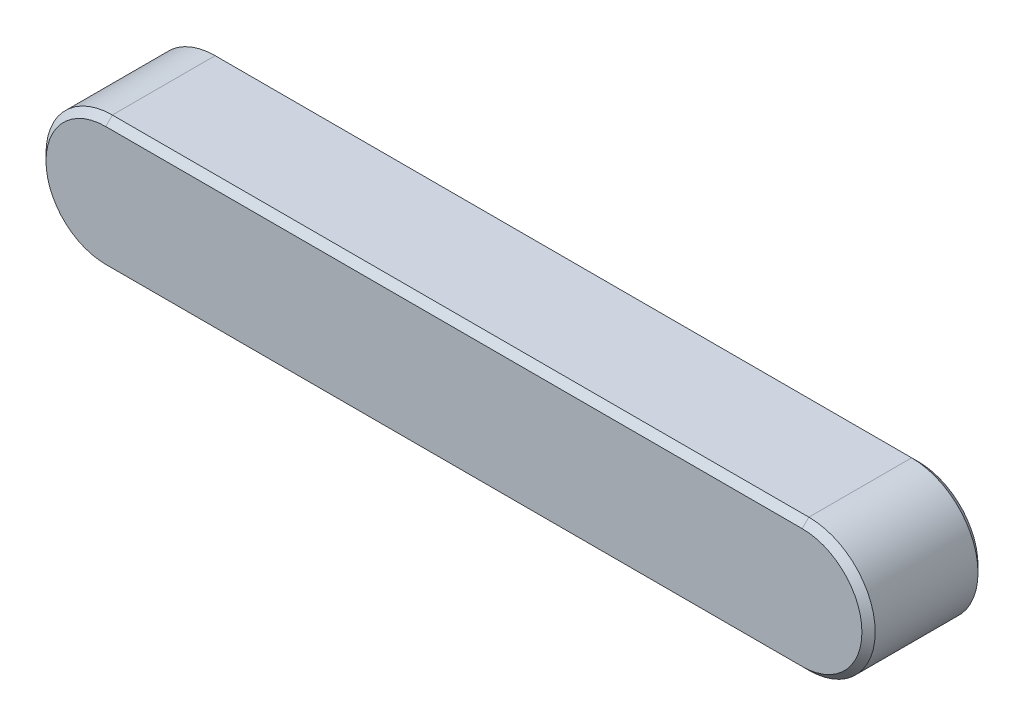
ISO-10303-21;
HEADER;
FILE_DESCRIPTION(('STEP AP214'),'2;1');
FILE_NAME('part.step','',(''),(''),'','','');
FILE_SCHEMA(('AUTOMOTIVE_DESIGN { 1 0 10303 214 1 1 1 1 }'));
ENDSEC;
DATA;
#1=APPLICATION_CONTEXT('core data for automotive mechanical design processes');
#2=APPLICATION_PROTOCOL_DEFINITION('international standard','automotive_design',2000,#1);
#3=PRODUCT_CONTEXT('',#1,'mechanical');
#4=PRODUCT('Part','Part','',(#3));
#5=PRODUCT_RELATED_PRODUCT_CATEGORY('part','',(#4));
#6=PRODUCT_DEFINITION_FORMATION('','',#4);
#7=PRODUCT_DEFINITION_CONTEXT('part definition',#1,'design');
#8=PRODUCT_DEFINITION('design','',#6,#7);
#9=PRODUCT_DEFINITION_SHAPE('','',#8);
#10=(LENGTH_UNIT() NAMED_UNIT(*) SI_UNIT(.MILLI.,.METRE.));
#11=(NAMED_UNIT(*) PLANE_ANGLE_UNIT() SI_UNIT($,.RADIAN.));
#12=(NAMED_UNIT(*) SI_UNIT($,.STERADIAN.) SOLID_ANGLE_UNIT());
#13=UNCERTAINTY_MEASURE_WITH_UNIT(LENGTH_MEASURE(1.E-05),#10,'distance_accuracy_value','');
#14=(GEOMETRIC_REPRESENTATION_CONTEXT(3) GLOBAL_UNCERTAINTY_ASSIGNED_CONTEXT((#13)) GLOBAL_UNIT_ASSIGNED_CONTEXT((#10,
#11,#12)) REPRESENTATION_CONTEXT('',''));
#15=CARTESIAN_POINT('',(0.,0.,0.));
#16=DIRECTION('',(0.,0.,1.));
#17=DIRECTION('',(1.,0.,0.));
#18=AXIS2_PLACEMENT_3D('',#15,#16,#17);
#19=CARTESIAN_POINT('',(0.,8.,7.));
#20=DIRECTION('',(0.,-1.,0.));
#21=DIRECTION('',(0.,0.,-1.));
#22=AXIS2_PLACEMENT_3D('',#19,#20,#21);
#23=PLANE('',#22);
#24=DIRECTION('',(0.,0.,-1.));
#25=VECTOR('',#24,1.);
#26=CARTESIAN_POINT('',(42.,8.,7.));
#27=LINE('',#26,#25);
#28=CARTESIAN_POINT('',(42.,8.,6.6));
#29=VERTEX_POINT('',#28);
#30=CARTESIAN_POINT('',(42.,8.,0.400000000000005));
#31=VERTEX_POINT('',#30);
#32=EDGE_CURVE('E146',#29,#31,#27,.T.);
#33=ORIENTED_EDGE('',*,*,#32,.T.);
#34=DIRECTION('',(-1.,0.,0.));
#35=VECTOR('',#34,1.);
#36=CARTESIAN_POINT('',(0.,8.,0.400000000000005));
#37=LINE('',#36,#35);
#38=CARTESIAN_POINT('',(0.,8.,0.400000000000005));
#39=VERTEX_POINT('',#38);
#40=EDGE_CURVE('E157',#31,#39,#37,.T.);
#41=ORIENTED_EDGE('',*,*,#40,.T.);
#42=DIRECTION('',(0.,0.,-1.));
#43=VECTOR('',#42,1.);
#44=CARTESIAN_POINT('',(0.,8.,7.));
#45=LINE('',#44,#43);
#46=CARTESIAN_POINT('',(0.,8.,6.6));
#47=VERTEX_POINT('',#46);
#48=EDGE_CURVE('E128',#47,#39,#45,.T.);
#49=ORIENTED_EDGE('',*,*,#48,.F.);
#50=DIRECTION('',(1.,0.,0.));
#51=VECTOR('',#50,1.);
#52=CARTESIAN_POINT('',(42.,8.,6.6));
#53=LINE('',#52,#51);
#54=EDGE_CURVE('E159',#47,#29,#53,.T.);
#55=ORIENTED_EDGE('',*,*,#54,.T.);
#56=EDGE_LOOP('',(#33,#41,#49,#55));
#57=FACE_BOUND('',#56,.T.);
#58=ADVANCED_FACE('F41',(#57),#23,.F.);
#59=CARTESIAN_POINT('',(0.,4.,7.));
#60=DIRECTION('',(0.,0.,-1.));
#61=DIRECTION('',(-1.,0.,0.));
#62=AXIS2_PLACEMENT_3D('',#59,#60,#61);
#63=CYLINDRICAL_SURFACE('',#62,4.);
#64=ORIENTED_EDGE('',*,*,#48,.T.);
#65=CARTESIAN_POINT('',(0.,4.,0.400000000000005));
#66=DIRECTION('',(0.,0.,1.));
#67=DIRECTION('',(1.,0.,0.));
#68=AXIS2_PLACEMENT_3D('',#65,#66,#67);
#69=CIRCLE('',#68,4.);
#70=CARTESIAN_POINT('',(0.,0.,0.400000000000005));
#71=VERTEX_POINT('',#70);
#72=EDGE_CURVE('E130',#39,#71,#69,.T.);
#73=ORIENTED_EDGE('',*,*,#72,.T.);
#74=DIRECTION('',(0.,0.,-1.));
#75=VECTOR('',#74,1.);
#76=CARTESIAN_POINT('',(0.,0.,7.));
#77=LINE('',#76,#75);
#78=CARTESIAN_POINT('',(0.,0.,6.6));
#79=VERTEX_POINT('',#78);
#80=EDGE_CURVE('E109',#79,#71,#77,.T.);
#81=ORIENTED_EDGE('',*,*,#80,.F.);
#82=CARTESIAN_POINT('',(0.,4.,6.6));
#83=DIRECTION('',(0.,0.,1.));
#84=DIRECTION('',(1.,0.,0.));
#85=AXIS2_PLACEMENT_3D('',#82,#83,#84);
#86=CIRCLE('',#85,4.);
#87=EDGE_CURVE('E123',#79,#47,#86,.F.);
#88=ORIENTED_EDGE('',*,*,#87,.T.);
#89=EDGE_LOOP('',(#64,#73,#81,#88));
#90=FACE_BOUND('',#89,.T.);
#91=ADVANCED_FACE('F121',(#90),#63,.T.);
#92=CARTESIAN_POINT('',(0.,0.,7.));
#93=DIRECTION('',(0.,-1.,0.));
#94=DIRECTION('',(0.,0.,-1.));
#95=AXIS2_PLACEMENT_3D('',#92,#93,#94);
#96=PLANE('',#95);
#97=ORIENTED_EDGE('',*,*,#80,.T.);
#98=DIRECTION('',(1.,0.,0.));
#99=VECTOR('',#98,1.);
#100=CARTESIAN_POINT('',(42.,0.,0.400000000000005));
#101=LINE('',#100,#99);
#102=CARTESIAN_POINT('',(42.,0.,0.400000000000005));
#103=VERTEX_POINT('',#102);
#104=EDGE_CURVE('E120',#71,#103,#101,.T.);
#105=ORIENTED_EDGE('',*,*,#104,.T.);
#106=DIRECTION('',(0.,0.,-1.));
#107=VECTOR('',#106,1.);
#108=CARTESIAN_POINT('',(42.,0.,7.));
#109=LINE('',#108,#107);
#110=CARTESIAN_POINT('',(42.,0.,6.6));
#111=VERTEX_POINT('',#110);
#112=EDGE_CURVE('E115',#111,#103,#109,.T.);
#113=ORIENTED_EDGE('',*,*,#112,.F.);
#114=DIRECTION('',(-1.,0.,0.));
#115=VECTOR('',#114,1.);
#116=CARTESIAN_POINT('',(0.,0.,6.6));
#117=LINE('',#116,#115);
#118=EDGE_CURVE('E110',#111,#79,#117,.T.);
#119=ORIENTED_EDGE('',*,*,#118,.T.);
#120=EDGE_LOOP('',(#97,#105,#113,#119));
#121=FACE_BOUND('',#120,.T.);
#122=ADVANCED_FACE('F107',(#121),#96,.T.);
#123=CARTESIAN_POINT('',(42.,4.,7.));
#124=DIRECTION('',(0.,0.,-1.));
#125=DIRECTION('',(-1.,0.,0.));
#126=AXIS2_PLACEMENT_3D('',#123,#124,#125);
#127=CYLINDRICAL_SURFACE('',#126,4.);
#128=ORIENTED_EDGE('',*,*,#112,.T.);
#129=CARTESIAN_POINT('',(42.,4.,0.400000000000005));
#130=DIRECTION('',(0.,0.,1.));
#131=DIRECTION('',(1.,0.,0.));
#132=AXIS2_PLACEMENT_3D('',#129,#130,#131);
#133=CIRCLE('',#132,4.);
#134=EDGE_CURVE('E162',#103,#31,#133,.T.);
#135=ORIENTED_EDGE('',*,*,#134,.T.);
#136=ORIENTED_EDGE('',*,*,#32,.F.);
#137=CARTESIAN_POINT('',(42.,4.,6.6));
#138=DIRECTION('',(0.,0.,1.));
#139=DIRECTION('',(1.,0.,0.));
#140=AXIS2_PLACEMENT_3D('',#137,#138,#139);
#141=CIRCLE('',#140,4.);
#142=EDGE_CURVE('E165',#29,#111,#141,.F.);
#143=ORIENTED_EDGE('',*,*,#142,.T.);
#144=EDGE_LOOP('',(#128,#135,#136,#143));
#145=FACE_BOUND('',#144,.T.);
#146=ADVANCED_FACE('F205',(#145),#127,.T.);
#147=CARTESIAN_POINT('',(0.,0.,7.));
#148=DIRECTION('',(0.,0.,1.));
#149=DIRECTION('',(1.,0.,0.));
#150=AXIS2_PLACEMENT_3D('',#147,#148,#149);
#151=PLANE('',#150);
#152=DIRECTION('',(1.,0.,0.));
#153=VECTOR('',#152,1.);
#154=CARTESIAN_POINT('',(0.,0.399999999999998,7.));
#155=LINE('',#154,#153);
#156=CARTESIAN_POINT('',(0.,0.399999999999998,7.));
#157=VERTEX_POINT('',#156);
#158=CARTESIAN_POINT('',(42.,0.399999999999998,7.));
#159=VERTEX_POINT('',#158);
#160=EDGE_CURVE('E49',#157,#159,#155,.T.);
#161=ORIENTED_EDGE('',*,*,#160,.T.);
#162=CARTESIAN_POINT('',(42.,4.,7.));
#163=DIRECTION('',(0.,0.,1.));
#164=DIRECTION('',(1.,0.,0.));
#165=AXIS2_PLACEMENT_3D('',#162,#163,#164);
#166=CIRCLE('',#165,3.6);
#167=CARTESIAN_POINT('',(42.,7.6,7.));
#168=VERTEX_POINT('',#167);
#169=EDGE_CURVE('E11',#159,#168,#166,.T.);
#170=ORIENTED_EDGE('',*,*,#169,.T.);
#171=DIRECTION('',(-1.,0.,0.));
#172=VECTOR('',#171,1.);
#173=CARTESIAN_POINT('',(0.,7.6,7.));
#174=LINE('',#173,#172);
#175=CARTESIAN_POINT('',(0.,7.6,7.));
#176=VERTEX_POINT('',#175);
#177=EDGE_CURVE('E156',#168,#176,#174,.T.);
#178=ORIENTED_EDGE('',*,*,#177,.T.);
#179=CARTESIAN_POINT('',(0.,4.,7.));
#180=DIRECTION('',(0.,0.,1.));
#181=DIRECTION('',(1.,0.,0.));
#182=AXIS2_PLACEMENT_3D('',#179,#180,#181);
#183=CIRCLE('',#182,3.6);
#184=EDGE_CURVE('E64',#176,#157,#183,.T.);
#185=ORIENTED_EDGE('',*,*,#184,.T.);
#186=EDGE_LOOP('',(#161,#170,#178,#185));
#187=FACE_BOUND('',#186,.T.);
#188=ADVANCED_FACE('F210',(#187),#151,.T.);
#189=CARTESIAN_POINT('',(0.,0.,0.));
#190=DIRECTION('',(0.,0.,1.));
#191=DIRECTION('',(1.,0.,0.));
#192=AXIS2_PLACEMENT_3D('',#189,#190,#191);
#193=PLANE('',#192);
#194=DIRECTION('',(-1.,0.,0.));
#195=VECTOR('',#194,1.);
#196=CARTESIAN_POINT('',(0.,0.400000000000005,0.));
#197=LINE('',#196,#195);
#198=CARTESIAN_POINT('',(42.,0.400000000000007,0.));
#199=VERTEX_POINT('',#198);
#200=CARTESIAN_POINT('',(0.,0.400000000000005,0.));
#201=VERTEX_POINT('',#200);
#202=EDGE_CURVE('E169',#199,#201,#197,.T.);
#203=ORIENTED_EDGE('',*,*,#202,.T.);
#204=CARTESIAN_POINT('',(0.,4.,0.));
#205=DIRECTION('',(0.,0.,1.));
#206=DIRECTION('',(1.,0.,0.));
#207=AXIS2_PLACEMENT_3D('',#204,#205,#206);
#208=CIRCLE('',#207,3.6);
#209=CARTESIAN_POINT('',(0.,7.6,0.));
#210=VERTEX_POINT('',#209);
#211=EDGE_CURVE('E117',#201,#210,#208,.F.);
#212=ORIENTED_EDGE('',*,*,#211,.T.);
#213=DIRECTION('',(1.,0.,0.));
#214=VECTOR('',#213,1.);
#215=CARTESIAN_POINT('',(0.,7.6,0.));
#216=LINE('',#215,#214);
#217=CARTESIAN_POINT('',(42.,7.6,0.));
#218=VERTEX_POINT('',#217);
#219=EDGE_CURVE('E173',#210,#218,#216,.T.);
#220=ORIENTED_EDGE('',*,*,#219,.T.);
#221=CARTESIAN_POINT('',(42.,4.,0.));
#222=DIRECTION('',(0.,0.,1.));
#223=DIRECTION('',(1.,0.,0.));
#224=AXIS2_PLACEMENT_3D('',#221,#222,#223);
#225=CIRCLE('',#224,3.6);
#226=EDGE_CURVE('E171',#218,#199,#225,.F.);
#227=ORIENTED_EDGE('',*,*,#226,.T.);
#228=EDGE_LOOP('',(#203,#212,#220,#227));
#229=FACE_BOUND('',#228,.T.);
#230=ADVANCED_FACE('F235',(#229),#193,.F.);
#231=CARTESIAN_POINT('',(42.,4.,0.));
#232=DIRECTION('',(0.,0.,1.));
#233=DIRECTION('',(1.,0.,0.));
#234=AXIS2_PLACEMENT_3D('',#231,#232,#233);
#235=CONICAL_SURFACE('',#234,3.6,0.785398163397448);
#236=DIRECTION('',(0.,-0.707106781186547,0.707106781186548));
#237=VECTOR('',#236,1.);
#238=CARTESIAN_POINT('',(42.,0.400000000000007,0.));
#239=LINE('',#238,#237);
#240=EDGE_CURVE('E150',#199,#103,#239,.T.);
#241=ORIENTED_EDGE('',*,*,#240,.F.);
#242=ORIENTED_EDGE('',*,*,#226,.F.);
#243=DIRECTION('',(0.,-0.707106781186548,-0.707106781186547));
#244=VECTOR('',#243,1.);
#245=CARTESIAN_POINT('',(42.,8.,0.400000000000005));
#246=LINE('',#245,#244);
#247=EDGE_CURVE('E144',#31,#218,#246,.T.);
#248=ORIENTED_EDGE('',*,*,#247,.F.);
#249=ORIENTED_EDGE('',*,*,#134,.F.);
#250=EDGE_LOOP('',(#241,#242,#248,#249));
#251=FACE_BOUND('',#250,.T.);
#252=ADVANCED_FACE('F186',(#251),#235,.T.);
#253=CARTESIAN_POINT('',(0.,8.,0.400000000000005));
#254=DIRECTION('',(0.,-0.707106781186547,0.707106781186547));
#255=DIRECTION('',(0.,-0.707106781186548,-0.707106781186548));
#256=AXIS2_PLACEMENT_3D('',#253,#254,#255);
#257=PLANE('',#256);
#258=ORIENTED_EDGE('',*,*,#247,.T.);
#259=ORIENTED_EDGE('',*,*,#219,.F.);
#260=DIRECTION('',(0.,-0.707106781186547,-0.707106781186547));
#261=VECTOR('',#260,1.);
#262=CARTESIAN_POINT('',(0.,8.,0.400000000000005));
#263=LINE('',#262,#261);
#264=EDGE_CURVE('E153',#39,#210,#263,.T.);
#265=ORIENTED_EDGE('',*,*,#264,.F.);
#266=ORIENTED_EDGE('',*,*,#40,.F.);
#267=EDGE_LOOP('',(#258,#259,#265,#266));
#268=FACE_BOUND('',#267,.T.);
#269=ADVANCED_FACE('F195',(#268),#257,.F.);
#270=CARTESIAN_POINT('',(0.,0.400000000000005,0.));
#271=DIRECTION('',(0.,-0.707106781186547,-0.707106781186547));
#272=DIRECTION('',(0.,0.707106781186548,-0.707106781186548));
#273=AXIS2_PLACEMENT_3D('',#270,#271,#272);
#274=PLANE('',#273);
#275=ORIENTED_EDGE('',*,*,#240,.T.);
#276=ORIENTED_EDGE('',*,*,#104,.F.);
#277=DIRECTION('',(0.,-0.707106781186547,0.707106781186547));
#278=VECTOR('',#277,1.);
#279=CARTESIAN_POINT('',(0.,0.400000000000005,0.));
#280=LINE('',#279,#278);
#281=EDGE_CURVE('E138',#201,#71,#280,.T.);
#282=ORIENTED_EDGE('',*,*,#281,.F.);
#283=ORIENTED_EDGE('',*,*,#202,.F.);
#284=EDGE_LOOP('',(#275,#276,#282,#283));
#285=FACE_BOUND('',#284,.T.);
#286=ADVANCED_FACE('F201',(#285),#274,.T.);
#287=CARTESIAN_POINT('',(0.,4.,0.400000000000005));
#288=DIRECTION('',(0.,0.,1.));
#289=DIRECTION('',(1.,0.,0.));
#290=AXIS2_PLACEMENT_3D('',#287,#288,#289);
#291=CONICAL_SURFACE('',#290,4.,0.785398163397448);
#292=ORIENTED_EDGE('',*,*,#264,.T.);
#293=ORIENTED_EDGE('',*,*,#211,.F.);
#294=ORIENTED_EDGE('',*,*,#281,.T.);
#295=ORIENTED_EDGE('',*,*,#72,.F.);
#296=EDGE_LOOP('',(#292,#293,#294,#295));
#297=FACE_BOUND('',#296,.T.);
#298=ADVANCED_FACE('F198',(#297),#291,.T.);
#299=CARTESIAN_POINT('',(0.,4.,7.));
#300=DIRECTION('',(0.,0.,-1.));
#301=DIRECTION('',(-1.,0.,0.));
#302=AXIS2_PLACEMENT_3D('',#299,#300,#301);
#303=CONICAL_SURFACE('',#302,3.6,0.785398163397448);
#304=DIRECTION('',(0.,-0.707106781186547,-0.707106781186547));
#305=VECTOR('',#304,1.);
#306=CARTESIAN_POINT('',(0.,0.399999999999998,7.));
#307=LINE('',#306,#305);
#308=EDGE_CURVE('E132',#157,#79,#307,.T.);
#309=ORIENTED_EDGE('',*,*,#308,.F.);
#310=ORIENTED_EDGE('',*,*,#184,.F.);
#311=DIRECTION('',(0.,-0.707106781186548,0.707106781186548));
#312=VECTOR('',#311,1.);
#313=CARTESIAN_POINT('',(0.,8.,6.6));
#314=LINE('',#313,#312);
#315=EDGE_CURVE('E44',#47,#176,#314,.T.);
#316=ORIENTED_EDGE('',*,*,#315,.F.);
#317=ORIENTED_EDGE('',*,*,#87,.F.);
#318=EDGE_LOOP('',(#309,#310,#316,#317));
#319=FACE_BOUND('',#318,.T.);
#320=ADVANCED_FACE('F43',(#319),#303,.T.);
#321=CARTESIAN_POINT('',(0.,7.6,7.));
#322=DIRECTION('',(0.,0.707106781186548,0.707106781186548));
#323=DIRECTION('',(0.,-0.707106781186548,0.707106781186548));
#324=AXIS2_PLACEMENT_3D('',#321,#322,#323);
#325=PLANE('',#324);
#326=ORIENTED_EDGE('',*,*,#315,.T.);
#327=ORIENTED_EDGE('',*,*,#177,.F.);
#328=DIRECTION('',(0.,-0.707106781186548,0.707106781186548));
#329=VECTOR('',#328,1.);
#330=CARTESIAN_POINT('',(42.,8.,6.6));
#331=LINE('',#330,#329);
#332=EDGE_CURVE('E137',#29,#168,#331,.T.);
#333=ORIENTED_EDGE('',*,*,#332,.F.);
#334=ORIENTED_EDGE('',*,*,#54,.F.);
#335=EDGE_LOOP('',(#326,#327,#333,#334));
#336=FACE_BOUND('',#335,.T.);
#337=ADVANCED_FACE('F209',(#336),#325,.T.);
#338=CARTESIAN_POINT('',(0.,0.,6.6));
#339=DIRECTION('',(0.,0.707106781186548,-0.707106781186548));
#340=DIRECTION('',(0.,0.707106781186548,0.707106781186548));
#341=AXIS2_PLACEMENT_3D('',#338,#339,#340);
#342=PLANE('',#341);
#343=ORIENTED_EDGE('',*,*,#308,.T.);
#344=ORIENTED_EDGE('',*,*,#118,.F.);
#345=DIRECTION('',(0.,-0.707106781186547,-0.707106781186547));
#346=VECTOR('',#345,1.);
#347=CARTESIAN_POINT('',(42.,0.399999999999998,7.));
#348=LINE('',#347,#346);
#349=EDGE_CURVE('E139',#159,#111,#348,.T.);
#350=ORIENTED_EDGE('',*,*,#349,.F.);
#351=ORIENTED_EDGE('',*,*,#160,.F.);
#352=EDGE_LOOP('',(#343,#344,#350,#351));
#353=FACE_BOUND('',#352,.T.);
#354=ADVANCED_FACE('F140',(#353),#342,.F.);
#355=CARTESIAN_POINT('',(42.,4.,6.6));
#356=DIRECTION('',(0.,0.,-1.));
#357=DIRECTION('',(-1.,0.,0.));
#358=AXIS2_PLACEMENT_3D('',#355,#356,#357);
#359=CONICAL_SURFACE('',#358,4.,0.785398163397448);
#360=ORIENTED_EDGE('',*,*,#332,.T.);
#361=ORIENTED_EDGE('',*,*,#169,.F.);
#362=ORIENTED_EDGE('',*,*,#349,.T.);
#363=ORIENTED_EDGE('',*,*,#142,.F.);
#364=EDGE_LOOP('',(#360,#361,#362,#363));
#365=FACE_BOUND('',#364,.T.);
#366=ADVANCED_FACE('F204',(#365),#359,.T.);
#367=CLOSED_SHELL('',(#58,#91,#122,#146,#188,#230,#252,#269,#286,#298,#320,#337,#354,#366));
#368=MANIFOLD_SOLID_BREP('B2',#367);
#369=ADVANCED_BREP_SHAPE_REPRESENTATION('',(#18,#368),#14);
#370=SHAPE_DEFINITION_REPRESENTATION(#9,#369);
ENDSEC;
END-ISO-10303-21;
